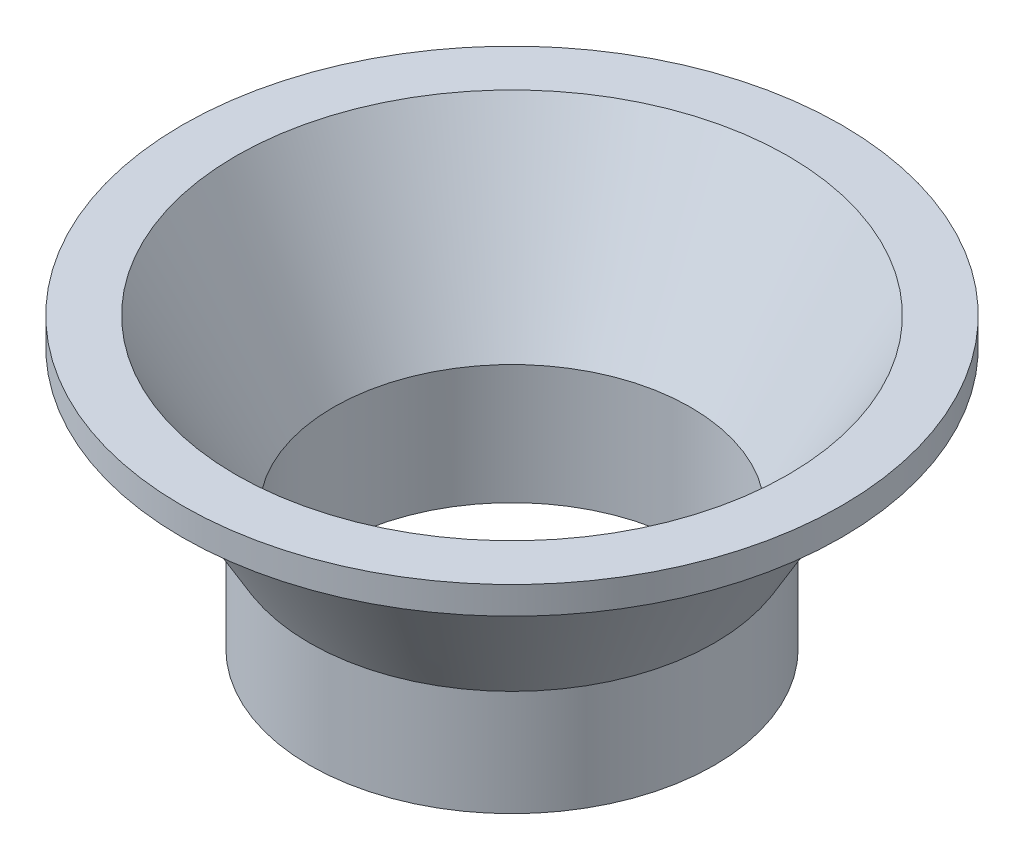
ISO-10303-21;
HEADER;
FILE_DESCRIPTION(('STEP AP214'),'2;1');
FILE_NAME('part.step','',(''),(''),'','','');
FILE_SCHEMA(('AUTOMOTIVE_DESIGN { 1 0 10303 214 1 1 1 1 }'));
ENDSEC;
DATA;
#1=APPLICATION_CONTEXT('core data for automotive mechanical design processes');
#2=APPLICATION_PROTOCOL_DEFINITION('international standard','automotive_design',2000,#1);
#3=PRODUCT_CONTEXT('',#1,'mechanical');
#4=PRODUCT('Part','Part','',(#3));
#5=PRODUCT_RELATED_PRODUCT_CATEGORY('part','',(#4));
#6=PRODUCT_DEFINITION_FORMATION('','',#4);
#7=PRODUCT_DEFINITION_CONTEXT('part definition',#1,'design');
#8=PRODUCT_DEFINITION('design','',#6,#7);
#9=PRODUCT_DEFINITION_SHAPE('','',#8);
#10=(LENGTH_UNIT() NAMED_UNIT(*) SI_UNIT(.MILLI.,.METRE.));
#11=(NAMED_UNIT(*) PLANE_ANGLE_UNIT() SI_UNIT($,.RADIAN.));
#12=(NAMED_UNIT(*) SI_UNIT($,.STERADIAN.) SOLID_ANGLE_UNIT());
#13=UNCERTAINTY_MEASURE_WITH_UNIT(LENGTH_MEASURE(1.E-05),#10,'distance_accuracy_value','');
#14=(GEOMETRIC_REPRESENTATION_CONTEXT(3) GLOBAL_UNCERTAINTY_ASSIGNED_CONTEXT((#13)) GLOBAL_UNIT_ASSIGNED_CONTEXT((#10,
#11,#12)) REPRESENTATION_CONTEXT('',''));
#15=CARTESIAN_POINT('',(0.,0.,0.));
#16=DIRECTION('',(0.,0.,1.));
#17=DIRECTION('',(1.,0.,0.));
#18=AXIS2_PLACEMENT_3D('',#15,#16,#17);
#19=CARTESIAN_POINT('',(0.,0.,0.));
#20=DIRECTION('',(0.,-1.,0.));
#21=DIRECTION('',(0.,0.,-1.));
#22=AXIS2_PLACEMENT_3D('',#19,#20,#21);
#23=CYLINDRICAL_SURFACE('',#22,6.5);
#24=DIRECTION('',(0.,-1.,0.));
#25=VECTOR('',#24,1.);
#26=CARTESIAN_POINT('',(-0.497647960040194,-1.075,6.48092173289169));
#27=LINE('',#26,#25);
#28=CARTESIAN_POINT('',(-0.497647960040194,-2.5,6.48092173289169));
#29=VERTEX_POINT('',#28);
#30=CARTESIAN_POINT('',(-0.497647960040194,0.35,6.48092173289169));
#31=VERTEX_POINT('',#30);
#32=EDGE_CURVE('E57',#29,#31,#27,.F.);
#33=ORIENTED_EDGE('',*,*,#32,.F.);
#34=CARTESIAN_POINT('',(0.,-2.5,0.));
#35=DIRECTION('',(0.,-1.,0.));
#36=DIRECTION('',(0.,0.,-1.));
#37=AXIS2_PLACEMENT_3D('',#34,#35,#36);
#38=CIRCLE('',#37,6.5);
#39=CARTESIAN_POINT('',(0.497647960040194,-2.5,6.48092173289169));
#40=VERTEX_POINT('',#39);
#41=EDGE_CURVE('E51',#29,#40,#38,.T.);
#42=ORIENTED_EDGE('',*,*,#41,.T.);
#43=DIRECTION('',(0.,-1.,0.));
#44=VECTOR('',#43,1.);
#45=CARTESIAN_POINT('',(0.497647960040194,-1.075,6.48092173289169));
#46=LINE('',#45,#44);
#47=CARTESIAN_POINT('',(0.497647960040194,0.35,6.48092173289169));
#48=VERTEX_POINT('',#47);
#49=EDGE_CURVE('E44',#48,#40,#46,.T.);
#50=ORIENTED_EDGE('',*,*,#49,.F.);
#51=CARTESIAN_POINT('',(0.,0.35,0.));
#52=DIRECTION('',(0.,-1.,0.));
#53=DIRECTION('',(0.,0.,-1.));
#54=AXIS2_PLACEMENT_3D('',#51,#52,#53);
#55=CIRCLE('',#54,6.5);
#56=EDGE_CURVE('E11',#48,#31,#55,.T.);
#57=ORIENTED_EDGE('',*,*,#56,.T.);
#58=EDGE_LOOP('',(#33,#42,#50,#57));
#59=FACE_BOUND('',#58,.T.);
#60=CARTESIAN_POINT('',(0.,1.85416206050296,0.));
#61=DIRECTION('',(0.,-1.,0.));
#62=DIRECTION('',(0.,0.,-1.));
#63=AXIS2_PLACEMENT_3D('',#60,#61,#62);
#64=CIRCLE('',#63,6.5);
#65=CARTESIAN_POINT('',(0.,1.85416206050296,-6.5));
#66=VERTEX_POINT('',#65);
#67=EDGE_CURVE('E34',#66,#66,#64,.T.);
#68=ORIENTED_EDGE('',*,*,#67,.F.);
#69=EDGE_LOOP('',(#68));
#70=FACE_BOUND('',#69,.T.);
#71=ADVANCED_FACE('F27',(#59,#70),#23,.F.);
#72=CARTESIAN_POINT('',(0.,8.,0.));
#73=DIRECTION('',(0.,1.,0.));
#74=DIRECTION('',(0.,0.,1.));
#75=AXIS2_PLACEMENT_3D('',#72,#73,#74);
#76=CONICAL_SURFACE('',#75,10.0483011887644,0.523598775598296);
#77=ORIENTED_EDGE('',*,*,#67,.T.);
#78=EDGE_LOOP('',(#77));
#79=FACE_BOUND('',#78,.T.);
#80=CARTESIAN_POINT('',(0.,8.,0.));
#81=DIRECTION('',(0.,-1.,0.));
#82=DIRECTION('',(0.,0.,-1.));
#83=AXIS2_PLACEMENT_3D('',#80,#81,#82);
#84=CIRCLE('',#83,10.0483011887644);
#85=CARTESIAN_POINT('',(0.,8.,-10.0483011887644));
#86=VERTEX_POINT('',#85);
#87=EDGE_CURVE('E84',#86,#86,#84,.T.);
#88=ORIENTED_EDGE('',*,*,#87,.F.);
#89=EDGE_LOOP('',(#88));
#90=FACE_BOUND('',#89,.T.);
#91=ADVANCED_FACE('F89',(#79,#90),#76,.F.);
#92=CARTESIAN_POINT('',(10.0483011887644,8.,0.));
#93=DIRECTION('',(0.,1.,0.));
#94=DIRECTION('',(0.,0.,1.));
#95=AXIS2_PLACEMENT_3D('',#92,#93,#94);
#96=PLANE('',#95);
#97=ORIENTED_EDGE('',*,*,#87,.T.);
#98=EDGE_LOOP('',(#97));
#99=FACE_BOUND('',#98,.T.);
#100=CARTESIAN_POINT('',(0.,8.,0.));
#101=DIRECTION('',(0.,-1.,0.));
#102=DIRECTION('',(0.,0.,-1.));
#103=AXIS2_PLACEMENT_3D('',#100,#101,#102);
#104=CIRCLE('',#103,12.);
#105=CARTESIAN_POINT('',(0.,8.,-12.));
#106=VERTEX_POINT('',#105);
#107=EDGE_CURVE('E81',#106,#106,#104,.T.);
#108=ORIENTED_EDGE('',*,*,#107,.F.);
#109=EDGE_LOOP('',(#108));
#110=FACE_BOUND('',#109,.T.);
#111=ADVANCED_FACE('F97',(#99,#110),#96,.T.);
#112=CARTESIAN_POINT('',(0.,0.,0.));
#113=DIRECTION('',(0.,-1.,0.));
#114=DIRECTION('',(0.,0.,-1.));
#115=AXIS2_PLACEMENT_3D('',#112,#113,#114);
#116=CYLINDRICAL_SURFACE('',#115,12.);
#117=ORIENTED_EDGE('',*,*,#107,.T.);
#118=EDGE_LOOP('',(#117));
#119=FACE_BOUND('',#118,.T.);
#120=CARTESIAN_POINT('',(0.,7.,0.));
#121=DIRECTION('',(0.,-1.,0.));
#122=DIRECTION('',(0.,0.,-1.));
#123=AXIS2_PLACEMENT_3D('',#120,#121,#122);
#124=CIRCLE('',#123,12.);
#125=CARTESIAN_POINT('',(0.,7.,-12.));
#126=VERTEX_POINT('',#125);
#127=EDGE_CURVE('E78',#126,#126,#124,.T.);
#128=ORIENTED_EDGE('',*,*,#127,.F.);
#129=EDGE_LOOP('',(#128));
#130=FACE_BOUND('',#129,.T.);
#131=ADVANCED_FACE('F101',(#119,#130),#116,.T.);
#132=CARTESIAN_POINT('',(10.625651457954,7.,0.));
#133=DIRECTION('',(0.,-1.,0.));
#134=DIRECTION('',(0.,0.,-1.));
#135=AXIS2_PLACEMENT_3D('',#132,#133,#134);
#136=PLANE('',#135);
#137=ORIENTED_EDGE('',*,*,#127,.T.);
#138=EDGE_LOOP('',(#137));
#139=FACE_BOUND('',#138,.T.);
#140=CARTESIAN_POINT('',(0.,7.,0.));
#141=DIRECTION('',(0.,-1.,0.));
#142=DIRECTION('',(0.,0.,-1.));
#143=AXIS2_PLACEMENT_3D('',#140,#141,#142);
#144=CIRCLE('',#143,10.625651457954);
#145=CARTESIAN_POINT('',(0.,7.,-10.625651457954));
#146=VERTEX_POINT('',#145);
#147=EDGE_CURVE('E75',#146,#146,#144,.T.);
#148=ORIENTED_EDGE('',*,*,#147,.F.);
#149=EDGE_LOOP('',(#148));
#150=FACE_BOUND('',#149,.T.);
#151=ADVANCED_FACE('F107',(#139,#150),#136,.T.);
#152=CARTESIAN_POINT('',(0.,1.35416206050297,0.));
#153=DIRECTION('',(0.,1.,0.));
#154=DIRECTION('',(0.,0.,1.));
#155=AXIS2_PLACEMENT_3D('',#152,#153,#154);
#156=CONICAL_SURFACE('',#155,7.36602540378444,0.523598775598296);
#157=ORIENTED_EDGE('',*,*,#147,.T.);
#158=EDGE_LOOP('',(#157));
#159=FACE_BOUND('',#158,.T.);
#160=CARTESIAN_POINT('',(0.,1.35416206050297,0.));
#161=DIRECTION('',(0.,-1.,0.));
#162=DIRECTION('',(0.,0.,-1.));
#163=AXIS2_PLACEMENT_3D('',#160,#161,#162);
#164=CIRCLE('',#163,7.36602540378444);
#165=CARTESIAN_POINT('',(0.,1.35416206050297,-7.36602540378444));
#166=VERTEX_POINT('',#165);
#167=EDGE_CURVE('E72',#166,#166,#164,.T.);
#168=ORIENTED_EDGE('',*,*,#167,.F.);
#169=EDGE_LOOP('',(#168));
#170=FACE_BOUND('',#169,.T.);
#171=ADVANCED_FACE('F111',(#159,#170),#156,.T.);
#172=CARTESIAN_POINT('',(0.,0.,0.));
#173=DIRECTION('',(0.,-1.,0.));
#174=DIRECTION('',(0.,0.,-1.));
#175=AXIS2_PLACEMENT_3D('',#172,#173,#174);
#176=CYLINDRICAL_SURFACE('',#175,7.36602540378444);
#177=ORIENTED_EDGE('',*,*,#167,.T.);
#178=EDGE_LOOP('',(#177));
#179=FACE_BOUND('',#178,.T.);
#180=CARTESIAN_POINT('',(0.,-2.5,0.));
#181=DIRECTION('',(0.,-1.,0.));
#182=DIRECTION('',(0.,0.,-1.));
#183=AXIS2_PLACEMENT_3D('',#180,#181,#182);
#184=CIRCLE('',#183,7.36602540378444);
#185=CARTESIAN_POINT('',(0.,-2.5,-7.36602540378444));
#186=VERTEX_POINT('',#185);
#187=EDGE_CURVE('E56',#186,#186,#184,.T.);
#188=ORIENTED_EDGE('',*,*,#187,.F.);
#189=EDGE_LOOP('',(#188));
#190=FACE_BOUND('',#189,.T.);
#191=ADVANCED_FACE('F115',(#179,#190),#176,.T.);
#192=CARTESIAN_POINT('',(6.5,-2.5,0.));
#193=DIRECTION('',(0.,-1.,0.));
#194=DIRECTION('',(0.,0.,-1.));
#195=AXIS2_PLACEMENT_3D('',#192,#193,#194);
#196=PLANE('',#195);
#197=ORIENTED_EDGE('',*,*,#41,.F.);
#198=CARTESIAN_POINT('',(0.,-2.5,6.49945742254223));
#199=DIRECTION('',(0.,-1.,0.));
#200=DIRECTION('',(0.,0.,-1.));
#201=AXIS2_PLACEMENT_3D('',#198,#199,#200);
#202=CIRCLE('',#201,0.497993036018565);
#203=EDGE_CURVE('E55',#29,#40,#202,.T.);
#204=ORIENTED_EDGE('',*,*,#203,.T.);
#205=EDGE_LOOP('',(#197,#204));
#206=FACE_BOUND('',#205,.T.);
#207=ORIENTED_EDGE('',*,*,#187,.T.);
#208=EDGE_LOOP('',(#207));
#209=FACE_BOUND('',#208,.T.);
#210=ADVANCED_FACE('F52',(#206,#209),#196,.T.);
#211=CARTESIAN_POINT('',(0.,0.35,6.49945742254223));
#212=DIRECTION('',(0.,-1.,0.));
#213=DIRECTION('',(0.,0.,-1.));
#214=AXIS2_PLACEMENT_3D('',#211,#212,#213);
#215=CYLINDRICAL_SURFACE('',#214,0.497993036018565);
#216=ORIENTED_EDGE('',*,*,#203,.F.);
#217=ORIENTED_EDGE('',*,*,#32,.T.);
#218=CARTESIAN_POINT('',(0.,0.35,6.49945742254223));
#219=DIRECTION('',(0.,-1.,0.));
#220=DIRECTION('',(0.,0.,-1.));
#221=AXIS2_PLACEMENT_3D('',#218,#219,#220);
#222=CIRCLE('',#221,0.497993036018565);
#223=EDGE_CURVE('E65',#31,#48,#222,.T.);
#224=ORIENTED_EDGE('',*,*,#223,.T.);
#225=ORIENTED_EDGE('',*,*,#49,.T.);
#226=EDGE_LOOP('',(#216,#217,#224,#225));
#227=FACE_BOUND('',#226,.T.);
#228=ADVANCED_FACE('F64',(#227),#215,.T.);
#229=CARTESIAN_POINT('',(0.,0.35,6.49945742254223));
#230=DIRECTION('',(0.,-1.,0.));
#231=DIRECTION('',(0.,0.,-1.));
#232=AXIS2_PLACEMENT_3D('',#229,#230,#231);
#233=PLANE('',#232);
#234=ORIENTED_EDGE('',*,*,#56,.F.);
#235=ORIENTED_EDGE('',*,*,#223,.F.);
#236=EDGE_LOOP('',(#234,#235));
#237=FACE_BOUND('',#236,.T.);
#238=ADVANCED_FACE('F122',(#237),#233,.F.);
#239=CLOSED_SHELL('',(#71,#91,#111,#131,#151,#171,#191,#210,#228,#238));
#240=MANIFOLD_SOLID_BREP('B2',#239);
#241=ADVANCED_BREP_SHAPE_REPRESENTATION('',(#18,#240),#14);
#242=SHAPE_DEFINITION_REPRESENTATION(#9,#241);
ENDSEC;
END-ISO-10303-21;
